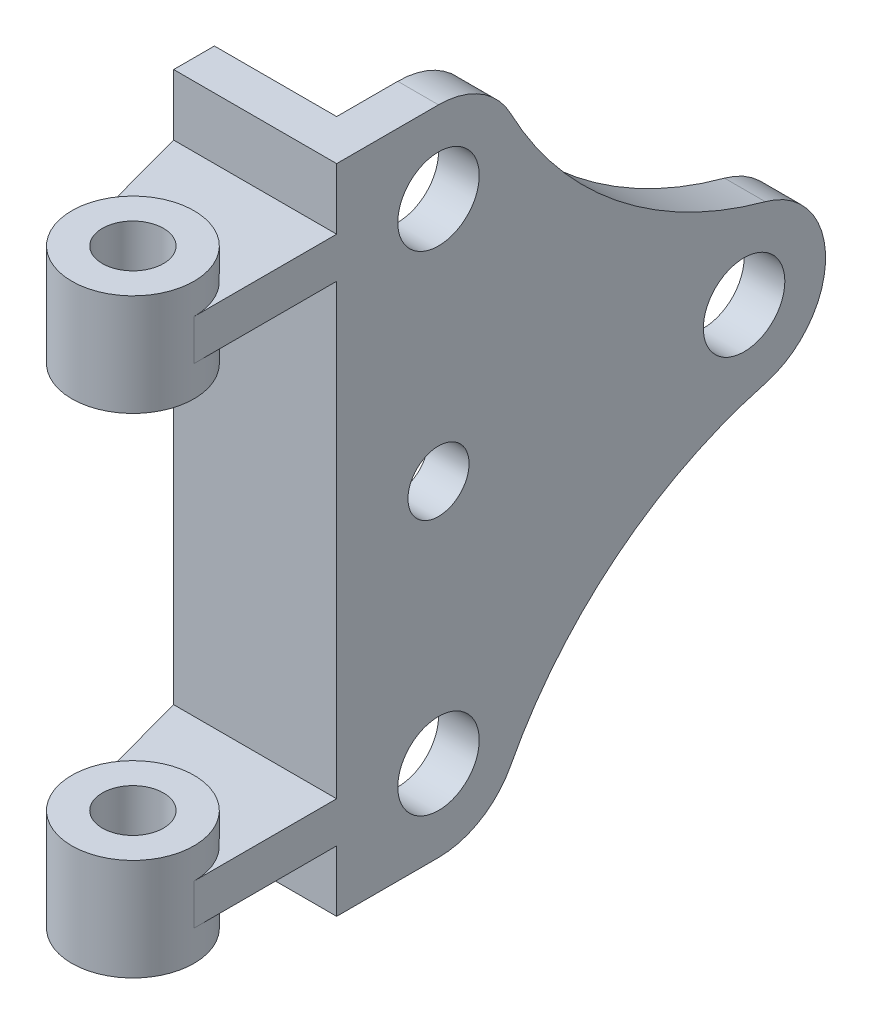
ISO-10303-21;
HEADER;
FILE_DESCRIPTION(('STEP AP214'),'2;1');
FILE_NAME('part.step','',(''),(''),'','','');
FILE_SCHEMA(('AUTOMOTIVE_DESIGN { 1 0 10303 214 1 1 1 1 }'));
ENDSEC;
DATA;
#1=APPLICATION_CONTEXT('core data for automotive mechanical design processes');
#2=APPLICATION_PROTOCOL_DEFINITION('international standard','automotive_design',2000,#1);
#3=PRODUCT_CONTEXT('',#1,'mechanical');
#4=PRODUCT('Part','Part','',(#3));
#5=PRODUCT_RELATED_PRODUCT_CATEGORY('part','',(#4));
#6=PRODUCT_DEFINITION_FORMATION('','',#4);
#7=PRODUCT_DEFINITION_CONTEXT('part definition',#1,'design');
#8=PRODUCT_DEFINITION('design','',#6,#7);
#9=PRODUCT_DEFINITION_SHAPE('','',#8);
#10=(LENGTH_UNIT() NAMED_UNIT(*) SI_UNIT(.MILLI.,.METRE.));
#11=(NAMED_UNIT(*) PLANE_ANGLE_UNIT() SI_UNIT($,.RADIAN.));
#12=(NAMED_UNIT(*) SI_UNIT($,.STERADIAN.) SOLID_ANGLE_UNIT());
#13=UNCERTAINTY_MEASURE_WITH_UNIT(LENGTH_MEASURE(1.E-05),#10,'distance_accuracy_value','');
#14=(GEOMETRIC_REPRESENTATION_CONTEXT(3) GLOBAL_UNCERTAINTY_ASSIGNED_CONTEXT((#13)) GLOBAL_UNIT_ASSIGNED_CONTEXT((#10,
#11,#12)) REPRESENTATION_CONTEXT('',''));
#15=CARTESIAN_POINT('',(0.,0.,0.));
#16=DIRECTION('',(0.,0.,1.));
#17=DIRECTION('',(1.,0.,0.));
#18=AXIS2_PLACEMENT_3D('',#15,#16,#17);
#19=CARTESIAN_POINT('',(-3.175,20.6375,22.225));
#20=DIRECTION('',(0.,-1.,0.));
#21=DIRECTION('',(0.,0.,1.));
#22=AXIS2_PLACEMENT_3D('',#19,#20,#21);
#23=PLANE('',#22);
#24=CARTESIAN_POINT('',(-3.175,20.6375,22.225));
#25=DIRECTION('',(0.,1.,0.));
#26=DIRECTION('',(0.,0.,1.));
#27=AXIS2_PLACEMENT_3D('',#24,#25,#26);
#28=CIRCLE('',#27,9.525);
#29=CARTESIAN_POINT('',(-3.175,20.6375,31.75));
#30=VERTEX_POINT('',#29);
#31=EDGE_CURVE('E696',#30,#30,#28,.T.);
#32=ORIENTED_EDGE('',*,*,#31,.T.);
#33=EDGE_LOOP('',(#32));
#34=FACE_BOUND('',#33,.T.);
#35=CARTESIAN_POINT('',(-3.175,20.6375,22.225));
#36=DIRECTION('',(0.,-1.,0.));
#37=DIRECTION('',(0.,0.,-1.));
#38=AXIS2_PLACEMENT_3D('',#35,#36,#37);
#39=CIRCLE('',#38,4.7625);
#40=CARTESIAN_POINT('',(-3.175,20.6375,17.4625));
#41=VERTEX_POINT('',#40);
#42=EDGE_CURVE('E695',#41,#41,#39,.F.);
#43=ORIENTED_EDGE('',*,*,#42,.F.);
#44=EDGE_LOOP('',(#43));
#45=FACE_BOUND('',#44,.T.);
#46=ADVANCED_FACE('F28',(#34,#45),#23,.F.);
#47=CARTESIAN_POINT('',(-3.175,4.7625,22.225));
#48=DIRECTION('',(0.,-1.,0.));
#49=DIRECTION('',(0.,0.,1.));
#50=AXIS2_PLACEMENT_3D('',#47,#48,#49);
#51=PLANE('',#50);
#52=CARTESIAN_POINT('',(-3.175,4.7625,22.225));
#53=DIRECTION('',(0.,1.,0.));
#54=DIRECTION('',(0.,0.,1.));
#55=AXIS2_PLACEMENT_3D('',#52,#53,#54);
#56=CIRCLE('',#55,9.525);
#57=CARTESIAN_POINT('',(-3.175,4.7625,31.75));
#58=VERTEX_POINT('',#57);
#59=EDGE_CURVE('E184',#58,#58,#56,.T.);
#60=ORIENTED_EDGE('',*,*,#59,.F.);
#61=EDGE_LOOP('',(#60));
#62=FACE_BOUND('',#61,.T.);
#63=CARTESIAN_POINT('',(-3.175,4.7625,22.225));
#64=DIRECTION('',(0.,1.,0.));
#65=DIRECTION('',(0.,0.,1.));
#66=AXIS2_PLACEMENT_3D('',#63,#64,#65);
#67=CIRCLE('',#66,4.7625);
#68=CARTESIAN_POINT('',(-3.175,4.7625,26.9875));
#69=VERTEX_POINT('',#68);
#70=EDGE_CURVE('E692',#69,#69,#67,.T.);
#71=ORIENTED_EDGE('',*,*,#70,.T.);
#72=EDGE_LOOP('',(#71));
#73=FACE_BOUND('',#72,.T.);
#74=ADVANCED_FACE('F450',(#62,#73),#51,.T.);
#75=CARTESIAN_POINT('',(6.35,0.,0.));
#76=DIRECTION('',(0.,0.,-1.));
#77=DIRECTION('',(-1.,0.,0.));
#78=AXIS2_PLACEMENT_3D('',#75,#76,#77);
#79=PLANE('',#78);
#80=DIRECTION('',(-1.,0.,0.));
#81=VECTOR('',#80,1.);
#82=CARTESIAN_POINT('',(-19.05,9.525,0.));
#83=LINE('',#82,#81);
#84=CARTESIAN_POINT('',(6.35,9.525,0.));
#85=VERTEX_POINT('',#84);
#86=CARTESIAN_POINT('',(-19.05,9.525,0.));
#87=VERTEX_POINT('',#86);
#88=EDGE_CURVE('E190',#85,#87,#83,.T.);
#89=ORIENTED_EDGE('',*,*,#88,.T.);
#90=DIRECTION('',(0.,-1.,0.));
#91=VECTOR('',#90,1.);
#92=CARTESIAN_POINT('',(-19.05,0.,0.));
#93=LINE('',#92,#91);
#94=CARTESIAN_POINT('',(-19.05,0.,0.));
#95=VERTEX_POINT('',#94);
#96=EDGE_CURVE('E230',#87,#95,#93,.T.);
#97=ORIENTED_EDGE('',*,*,#96,.T.);
#98=DIRECTION('',(-1.,0.,0.));
#99=VECTOR('',#98,1.);
#100=CARTESIAN_POINT('',(6.35,0.,0.));
#101=LINE('',#100,#99);
#102=CARTESIAN_POINT('',(6.35,0.,0.));
#103=VERTEX_POINT('',#102);
#104=EDGE_CURVE('E268',#103,#95,#101,.T.);
#105=ORIENTED_EDGE('',*,*,#104,.F.);
#106=DIRECTION('',(0.,-1.,0.));
#107=VECTOR('',#106,1.);
#108=CARTESIAN_POINT('',(6.35,0.,0.));
#109=LINE('',#108,#107);
#110=EDGE_CURVE('E43',#85,#103,#109,.T.);
#111=ORIENTED_EDGE('',*,*,#110,.F.);
#112=EDGE_LOOP('',(#89,#97,#105,#111));
#113=FACE_BOUND('',#112,.T.);
#114=ADVANCED_FACE('F456',(#113),#79,.F.);
#115=CARTESIAN_POINT('',(-3.175,92.075,22.225));
#116=DIRECTION('',(0.,-1.,0.));
#117=DIRECTION('',(0.,0.,-1.));
#118=AXIS2_PLACEMENT_3D('',#115,#116,#117);
#119=PLANE('',#118);
#120=CARTESIAN_POINT('',(-3.175,92.075,22.225));
#121=DIRECTION('',(0.,-1.,0.));
#122=DIRECTION('',(0.,0.,-1.));
#123=AXIS2_PLACEMENT_3D('',#120,#121,#122);
#124=CIRCLE('',#123,9.525);
#125=CARTESIAN_POINT('',(6.35,92.075,22.225));
#126=VERTEX_POINT('',#125);
#127=CARTESIAN_POINT('',(-12.3699464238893,92.075,24.7106760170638));
#128=VERTEX_POINT('',#127);
#129=EDGE_CURVE('E208',#126,#128,#124,.F.);
#130=ORIENTED_EDGE('',*,*,#129,.F.);
#131=DIRECTION('',(0.,0.,-1.));
#132=VECTOR('',#131,1.);
#133=CARTESIAN_POINT('',(6.35,92.075,0.));
#134=LINE('',#133,#132);
#135=CARTESIAN_POINT('',(6.35,92.075,0.));
#136=VERTEX_POINT('',#135);
#137=EDGE_CURVE('E398',#126,#136,#134,.T.);
#138=ORIENTED_EDGE('',*,*,#137,.T.);
#139=DIRECTION('',(-1.,0.,0.));
#140=VECTOR('',#139,1.);
#141=CARTESIAN_POINT('',(-19.05,92.075,0.));
#142=LINE('',#141,#140);
#143=CARTESIAN_POINT('',(-19.05,92.075,0.));
#144=VERTEX_POINT('',#143);
#145=EDGE_CURVE('E393',#136,#144,#142,.T.);
#146=ORIENTED_EDGE('',*,*,#145,.T.);
#147=DIRECTION('',(0.260963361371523,0.,0.965348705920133));
#148=VECTOR('',#147,1.);
#149=CARTESIAN_POINT('',(-12.3699464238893,92.075,24.7106760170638));
#150=LINE('',#149,#148);
#151=EDGE_CURVE('E220',#144,#128,#150,.T.);
#152=ORIENTED_EDGE('',*,*,#151,.T.);
#153=EDGE_LOOP('',(#130,#138,#146,#152));
#154=FACE_BOUND('',#153,.T.);
#155=ADVANCED_FACE('F422',(#154),#119,.F.);
#156=CARTESIAN_POINT('',(-3.175,85.725,22.225));
#157=DIRECTION('',(0.,-1.,0.));
#158=DIRECTION('',(0.,0.,-1.));
#159=AXIS2_PLACEMENT_3D('',#156,#157,#158);
#160=PLANE('',#159);
#161=DIRECTION('',(0.,0.,-1.));
#162=VECTOR('',#161,1.);
#163=CARTESIAN_POINT('',(6.35,85.725,0.));
#164=LINE('',#163,#162);
#165=CARTESIAN_POINT('',(6.35,85.725,22.225));
#166=VERTEX_POINT('',#165);
#167=CARTESIAN_POINT('',(6.35,85.725,0.));
#168=VERTEX_POINT('',#167);
#169=EDGE_CURVE('E221',#166,#168,#164,.T.);
#170=ORIENTED_EDGE('',*,*,#169,.F.);
#171=CARTESIAN_POINT('',(-3.175,85.725,22.225));
#172=DIRECTION('',(0.,-1.,0.));
#173=DIRECTION('',(0.,0.,-1.));
#174=AXIS2_PLACEMENT_3D('',#171,#172,#173);
#175=CIRCLE('',#174,9.525);
#176=CARTESIAN_POINT('',(-12.3699464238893,85.725,24.7106760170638));
#177=VERTEX_POINT('',#176);
#178=EDGE_CURVE('E36',#166,#177,#175,.F.);
#179=ORIENTED_EDGE('',*,*,#178,.T.);
#180=DIRECTION('',(0.260963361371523,0.,0.965348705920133));
#181=VECTOR('',#180,1.);
#182=CARTESIAN_POINT('',(-12.3699464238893,85.725,24.7106760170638));
#183=LINE('',#182,#181);
#184=CARTESIAN_POINT('',(-19.05,85.725,0.));
#185=VERTEX_POINT('',#184);
#186=EDGE_CURVE('E211',#185,#177,#183,.T.);
#187=ORIENTED_EDGE('',*,*,#186,.F.);
#188=DIRECTION('',(-1.,0.,0.));
#189=VECTOR('',#188,1.);
#190=CARTESIAN_POINT('',(-19.05,85.725,0.));
#191=LINE('',#190,#189);
#192=EDGE_CURVE('E217',#168,#185,#191,.T.);
#193=ORIENTED_EDGE('',*,*,#192,.F.);
#194=EDGE_LOOP('',(#170,#179,#187,#193));
#195=FACE_BOUND('',#194,.T.);
#196=ADVANCED_FACE('F416',(#195),#160,.T.);
#197=ORIENTED_EDGE('',*,*,#145,.F.);
#198=CARTESIAN_POINT('',(6.35,101.6,0.));
#199=VERTEX_POINT('',#198);
#200=EDGE_CURVE('E270',#199,#136,#109,.T.);
#201=ORIENTED_EDGE('',*,*,#200,.F.);
#202=DIRECTION('',(-1.,0.,0.));
#203=VECTOR('',#202,1.);
#204=CARTESIAN_POINT('',(6.35,101.6,0.));
#205=LINE('',#204,#203);
#206=CARTESIAN_POINT('',(-19.05,101.6,0.));
#207=VERTEX_POINT('',#206);
#208=EDGE_CURVE('E266',#199,#207,#205,.T.);
#209=ORIENTED_EDGE('',*,*,#208,.T.);
#210=EDGE_CURVE('E245',#207,#144,#93,.T.);
#211=ORIENTED_EDGE('',*,*,#210,.T.);
#212=EDGE_LOOP('',(#197,#201,#209,#211));
#213=FACE_BOUND('',#212,.T.);
#214=ADVANCED_FACE('F391',(#213),#79,.F.);
#215=CARTESIAN_POINT('',(0.,12.7,-15.875));
#216=DIRECTION('',(1.,0.,0.));
#217=DIRECTION('',(0.,0.,-1.));
#218=AXIS2_PLACEMENT_3D('',#215,#216,#217);
#219=PLANE('',#218);
#220=CARTESIAN_POINT('',(0.,50.8,-63.5));
#221=DIRECTION('',(1.,0.,0.));
#222=DIRECTION('',(0.,0.,-1.));
#223=AXIS2_PLACEMENT_3D('',#220,#221,#222);
#224=CIRCLE('',#223,6.35);
#225=CARTESIAN_POINT('',(0.,50.8,-69.85));
#226=VERTEX_POINT('',#225);
#227=EDGE_CURVE('E314',#226,#226,#224,.T.);
#228=ORIENTED_EDGE('',*,*,#227,.T.);
#229=EDGE_LOOP('',(#228));
#230=FACE_BOUND('',#229,.T.);
#231=CARTESIAN_POINT('',(0.,88.9,-15.875));
#232=DIRECTION('',(1.,0.,0.));
#233=DIRECTION('',(0.,0.,-1.));
#234=AXIS2_PLACEMENT_3D('',#231,#232,#233);
#235=CIRCLE('',#234,6.35);
#236=CARTESIAN_POINT('',(0.,88.9,-22.225));
#237=VERTEX_POINT('',#236);
#238=EDGE_CURVE('E320',#237,#237,#235,.T.);
#239=ORIENTED_EDGE('',*,*,#238,.T.);
#240=EDGE_LOOP('',(#239));
#241=FACE_BOUND('',#240,.T.);
#242=CARTESIAN_POINT('',(0.,12.7,-15.875));
#243=DIRECTION('',(1.,0.,0.));
#244=DIRECTION('',(0.,0.,-1.));
#245=AXIS2_PLACEMENT_3D('',#242,#243,#244);
#246=CIRCLE('',#245,6.35);
#247=CARTESIAN_POINT('',(0.,12.7,-22.225));
#248=VERTEX_POINT('',#247);
#249=EDGE_CURVE('E326',#248,#248,#246,.T.);
#250=ORIENTED_EDGE('',*,*,#249,.T.);
#251=EDGE_LOOP('',(#250));
#252=FACE_BOUND('',#251,.T.);
#253=CARTESIAN_POINT('',(0.,50.8,-15.875));
#254=DIRECTION('',(1.,0.,0.));
#255=DIRECTION('',(0.,0.,-1.));
#256=AXIS2_PLACEMENT_3D('',#253,#254,#255);
#257=CIRCLE('',#256,4.7625);
#258=CARTESIAN_POINT('',(0.,50.8,-20.6375));
#259=VERTEX_POINT('',#258);
#260=EDGE_CURVE('E332',#259,#259,#257,.T.);
#261=ORIENTED_EDGE('',*,*,#260,.T.);
#262=EDGE_LOOP('',(#261));
#263=FACE_BOUND('',#262,.T.);
#264=DIRECTION('',(0.,-1.,0.));
#265=VECTOR('',#264,1.);
#266=CARTESIAN_POINT('',(0.,12.7,-6.35));
#267=LINE('',#266,#265);
#268=CARTESIAN_POINT('',(0.,101.6,-6.35));
#269=VERTEX_POINT('',#268);
#270=CARTESIAN_POINT('',(0.,0.,-6.35));
#271=VERTEX_POINT('',#270);
#272=EDGE_CURVE('E229',#269,#271,#267,.T.);
#273=ORIENTED_EDGE('',*,*,#272,.F.);
#274=DIRECTION('',(0.,0.,1.));
#275=VECTOR('',#274,1.);
#276=CARTESIAN_POINT('',(0.,101.6,0.));
#277=LINE('',#276,#275);
#278=CARTESIAN_POINT('',(0.,101.6,-15.875));
#279=VERTEX_POINT('',#278);
#280=EDGE_CURVE('E299',#279,#269,#277,.T.);
#281=ORIENTED_EDGE('',*,*,#280,.F.);
#282=CARTESIAN_POINT('',(0.,88.9,-15.875));
#283=DIRECTION('',(1.,0.,0.));
#284=DIRECTION('',(0.,0.,1.));
#285=AXIS2_PLACEMENT_3D('',#282,#283,#284);
#286=CIRCLE('',#285,12.7);
#287=CARTESIAN_POINT('',(0.,94.8132663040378,-27.1143630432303));
#288=VERTEX_POINT('',#287);
#289=EDGE_CURVE('E302',#288,#279,#286,.T.);
#290=ORIENTED_EDGE('',*,*,#289,.F.);
#291=CARTESIAN_POINT('',(0.,124.379597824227,-83.3111782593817));
#292=DIRECTION('',(-1.,0.,0.));
#293=DIRECTION('',(0.,0.,-1.));
#294=AXIS2_PLACEMENT_3D('',#291,#292,#293);
#295=CIRCLE('',#294,63.5);
#296=CARTESIAN_POINT('',(0.,63.0632663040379,-66.8018630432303));
#297=VERTEX_POINT('',#296);
#298=EDGE_CURVE('E304',#297,#288,#295,.T.);
#299=ORIENTED_EDGE('',*,*,#298,.F.);
#300=CARTESIAN_POINT('',(0.,50.8,-63.5));
#301=DIRECTION('',(1.,0.,0.));
#302=DIRECTION('',(0.,0.,1.));
#303=AXIS2_PLACEMENT_3D('',#300,#301,#302);
#304=CIRCLE('',#303,12.7);
#305=CARTESIAN_POINT('',(0.,38.5367336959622,-66.8018630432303));
#306=VERTEX_POINT('',#305);
#307=EDGE_CURVE('E306',#306,#297,#304,.T.);
#308=ORIENTED_EDGE('',*,*,#307,.F.);
#309=CARTESIAN_POINT('',(0.,-22.7795978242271,-83.3111782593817));
#310=DIRECTION('',(-1.,0.,0.));
#311=DIRECTION('',(0.,0.,1.));
#312=AXIS2_PLACEMENT_3D('',#309,#310,#311);
#313=CIRCLE('',#312,63.5);
#314=CARTESIAN_POINT('',(0.,6.78673369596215,-27.1143630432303));
#315=VERTEX_POINT('',#314);
#316=EDGE_CURVE('E308',#315,#306,#313,.T.);
#317=ORIENTED_EDGE('',*,*,#316,.F.);
#318=CARTESIAN_POINT('',(0.,12.7,-15.875));
#319=DIRECTION('',(1.,0.,0.));
#320=DIRECTION('',(0.,0.,-1.));
#321=AXIS2_PLACEMENT_3D('',#318,#319,#320);
#322=CIRCLE('',#321,12.7);
#323=CARTESIAN_POINT('',(0.,0.,-15.875));
#324=VERTEX_POINT('',#323);
#325=EDGE_CURVE('E310',#324,#315,#322,.T.);
#326=ORIENTED_EDGE('',*,*,#325,.F.);
#327=DIRECTION('',(0.,0.,-1.));
#328=VECTOR('',#327,1.);
#329=CARTESIAN_POINT('',(0.,0.,0.));
#330=LINE('',#329,#328);
#331=EDGE_CURVE('E312',#271,#324,#330,.T.);
#332=ORIENTED_EDGE('',*,*,#331,.F.);
#333=EDGE_LOOP('',(#273,#281,#290,#299,#308,#317,#326,#332));
#334=FACE_BOUND('',#333,.T.);
#335=ADVANCED_FACE('F366',(#230,#241,#252,#263,#334),#219,.F.);
#336=CARTESIAN_POINT('',(6.35,0.,0.));
#337=DIRECTION('',(0.,1.,0.));
#338=DIRECTION('',(0.,0.,1.));
#339=AXIS2_PLACEMENT_3D('',#336,#337,#338);
#340=PLANE('',#339);
#341=ORIENTED_EDGE('',*,*,#104,.T.);
#342=DIRECTION('',(0.,0.,1.));
#343=VECTOR('',#342,1.);
#344=CARTESIAN_POINT('',(-19.05,0.,-6.35));
#345=LINE('',#344,#343);
#346=CARTESIAN_POINT('',(-19.05,0.,-6.35));
#347=VERTEX_POINT('',#346);
#348=EDGE_CURVE('E338',#347,#95,#345,.T.);
#349=ORIENTED_EDGE('',*,*,#348,.F.);
#350=DIRECTION('',(1.,0.,0.));
#351=VECTOR('',#350,1.);
#352=CARTESIAN_POINT('',(6.35,0.,-6.35));
#353=LINE('',#352,#351);
#354=EDGE_CURVE('E342',#347,#271,#353,.T.);
#355=ORIENTED_EDGE('',*,*,#354,.T.);
#356=ORIENTED_EDGE('',*,*,#331,.T.);
#357=DIRECTION('',(-1.,0.,0.));
#358=VECTOR('',#357,1.);
#359=CARTESIAN_POINT('',(6.35,0.,-15.875));
#360=LINE('',#359,#358);
#361=CARTESIAN_POINT('',(6.35,0.,-15.875));
#362=VERTEX_POINT('',#361);
#363=EDGE_CURVE('E248',#362,#324,#360,.T.);
#364=ORIENTED_EDGE('',*,*,#363,.F.);
#365=DIRECTION('',(0.,0.,-1.));
#366=VECTOR('',#365,1.);
#367=CARTESIAN_POINT('',(6.35,0.,0.));
#368=LINE('',#367,#366);
#369=EDGE_CURVE('E297',#103,#362,#368,.T.);
#370=ORIENTED_EDGE('',*,*,#369,.F.);
#371=EDGE_LOOP('',(#341,#349,#355,#356,#364,#370));
#372=FACE_BOUND('',#371,.T.);
#373=ADVANCED_FACE('F30',(#372),#340,.F.);
#374=CARTESIAN_POINT('',(6.35,12.7,-15.875));
#375=DIRECTION('',(-1.,0.,0.));
#376=DIRECTION('',(0.,0.,1.));
#377=AXIS2_PLACEMENT_3D('',#374,#375,#376);
#378=CYLINDRICAL_SURFACE('',#377,12.7);
#379=ORIENTED_EDGE('',*,*,#325,.T.);
#380=DIRECTION('',(-1.,0.,0.));
#381=VECTOR('',#380,1.);
#382=CARTESIAN_POINT('',(6.35,6.78673369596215,-27.1143630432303));
#383=LINE('',#382,#381);
#384=CARTESIAN_POINT('',(6.35,6.78673369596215,-27.1143630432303));
#385=VERTEX_POINT('',#384);
#386=EDGE_CURVE('E251',#385,#315,#383,.T.);
#387=ORIENTED_EDGE('',*,*,#386,.F.);
#388=CARTESIAN_POINT('',(6.35,12.7,-15.875));
#389=DIRECTION('',(1.,0.,0.));
#390=DIRECTION('',(0.,0.,-1.));
#391=AXIS2_PLACEMENT_3D('',#388,#389,#390);
#392=CIRCLE('',#391,12.7);
#393=EDGE_CURVE('E295',#362,#385,#392,.T.);
#394=ORIENTED_EDGE('',*,*,#393,.F.);
#395=ORIENTED_EDGE('',*,*,#363,.T.);
#396=EDGE_LOOP('',(#379,#387,#394,#395));
#397=FACE_BOUND('',#396,.T.);
#398=ADVANCED_FACE('F372',(#397),#378,.T.);
#399=CARTESIAN_POINT('',(6.35,-22.7795978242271,-83.3111782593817));
#400=DIRECTION('',(-1.,0.,0.));
#401=DIRECTION('',(0.,0.,1.));
#402=AXIS2_PLACEMENT_3D('',#399,#400,#401);
#403=CYLINDRICAL_SURFACE('',#402,63.5);
#404=ORIENTED_EDGE('',*,*,#316,.T.);
#405=DIRECTION('',(-1.,0.,0.));
#406=VECTOR('',#405,1.);
#407=CARTESIAN_POINT('',(6.35,38.5367336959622,-66.8018630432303));
#408=LINE('',#407,#406);
#409=CARTESIAN_POINT('',(6.35,38.5367336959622,-66.8018630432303));
#410=VERTEX_POINT('',#409);
#411=EDGE_CURVE('E254',#410,#306,#408,.T.);
#412=ORIENTED_EDGE('',*,*,#411,.F.);
#413=CARTESIAN_POINT('',(6.35,-22.7795978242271,-83.3111782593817));
#414=DIRECTION('',(-1.,0.,0.));
#415=DIRECTION('',(0.,0.,1.));
#416=AXIS2_PLACEMENT_3D('',#413,#414,#415);
#417=CIRCLE('',#416,63.5);
#418=EDGE_CURVE('E293',#385,#410,#417,.T.);
#419=ORIENTED_EDGE('',*,*,#418,.F.);
#420=ORIENTED_EDGE('',*,*,#386,.T.);
#421=EDGE_LOOP('',(#404,#412,#419,#420));
#422=FACE_BOUND('',#421,.T.);
#423=ADVANCED_FACE('F377',(#422),#403,.F.);
#424=CARTESIAN_POINT('',(6.35,50.8,-63.5));
#425=DIRECTION('',(-1.,0.,0.));
#426=DIRECTION('',(0.,0.,1.));
#427=AXIS2_PLACEMENT_3D('',#424,#425,#426);
#428=CYLINDRICAL_SURFACE('',#427,12.7);
#429=ORIENTED_EDGE('',*,*,#307,.T.);
#430=DIRECTION('',(-1.,0.,0.));
#431=VECTOR('',#430,1.);
#432=CARTESIAN_POINT('',(6.35,63.0632663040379,-66.8018630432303));
#433=LINE('',#432,#431);
#434=CARTESIAN_POINT('',(6.35,63.0632663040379,-66.8018630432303));
#435=VERTEX_POINT('',#434);
#436=EDGE_CURVE('E257',#435,#297,#433,.T.);
#437=ORIENTED_EDGE('',*,*,#436,.F.);
#438=CARTESIAN_POINT('',(6.35,50.8,-63.5));
#439=DIRECTION('',(1.,0.,0.));
#440=DIRECTION('',(0.,0.,1.));
#441=AXIS2_PLACEMENT_3D('',#438,#439,#440);
#442=CIRCLE('',#441,12.7);
#443=EDGE_CURVE('E289',#410,#435,#442,.T.);
#444=ORIENTED_EDGE('',*,*,#443,.F.);
#445=ORIENTED_EDGE('',*,*,#411,.T.);
#446=EDGE_LOOP('',(#429,#437,#444,#445));
#447=FACE_BOUND('',#446,.T.);
#448=ADVANCED_FACE('F381',(#447),#428,.T.);
#449=CARTESIAN_POINT('',(6.35,124.379597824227,-83.3111782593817));
#450=DIRECTION('',(-1.,0.,0.));
#451=DIRECTION('',(0.,0.,1.));
#452=AXIS2_PLACEMENT_3D('',#449,#450,#451);
#453=CYLINDRICAL_SURFACE('',#452,63.5);
#454=ORIENTED_EDGE('',*,*,#298,.T.);
#455=DIRECTION('',(-1.,0.,0.));
#456=VECTOR('',#455,1.);
#457=CARTESIAN_POINT('',(6.35,94.8132663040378,-27.1143630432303));
#458=LINE('',#457,#456);
#459=CARTESIAN_POINT('',(6.35,94.8132663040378,-27.1143630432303));
#460=VERTEX_POINT('',#459);
#461=EDGE_CURVE('E260',#460,#288,#458,.T.);
#462=ORIENTED_EDGE('',*,*,#461,.F.);
#463=CARTESIAN_POINT('',(6.35,124.379597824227,-83.3111782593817));
#464=DIRECTION('',(-1.,0.,0.));
#465=DIRECTION('',(0.,0.,-1.));
#466=AXIS2_PLACEMENT_3D('',#463,#464,#465);
#467=CIRCLE('',#466,63.5);
#468=EDGE_CURVE('E286',#435,#460,#467,.T.);
#469=ORIENTED_EDGE('',*,*,#468,.F.);
#470=ORIENTED_EDGE('',*,*,#436,.T.);
#471=EDGE_LOOP('',(#454,#462,#469,#470));
#472=FACE_BOUND('',#471,.T.);
#473=ADVANCED_FACE('F385',(#472),#453,.F.);
#474=CARTESIAN_POINT('',(6.35,88.9,-15.875));
#475=DIRECTION('',(-1.,0.,0.));
#476=DIRECTION('',(0.,0.,1.));
#477=AXIS2_PLACEMENT_3D('',#474,#475,#476);
#478=CYLINDRICAL_SURFACE('',#477,12.7);
#479=ORIENTED_EDGE('',*,*,#289,.T.);
#480=DIRECTION('',(-1.,0.,0.));
#481=VECTOR('',#480,1.);
#482=CARTESIAN_POINT('',(6.35,101.6,-15.875));
#483=LINE('',#482,#481);
#484=CARTESIAN_POINT('',(6.35,101.6,-15.875));
#485=VERTEX_POINT('',#484);
#486=EDGE_CURVE('E263',#485,#279,#483,.T.);
#487=ORIENTED_EDGE('',*,*,#486,.F.);
#488=CARTESIAN_POINT('',(6.35,88.9,-15.875));
#489=DIRECTION('',(1.,0.,0.));
#490=DIRECTION('',(0.,0.,1.));
#491=AXIS2_PLACEMENT_3D('',#488,#489,#490);
#492=CIRCLE('',#491,12.7);
#493=EDGE_CURVE('E283',#460,#485,#492,.T.);
#494=ORIENTED_EDGE('',*,*,#493,.F.);
#495=ORIENTED_EDGE('',*,*,#461,.T.);
#496=EDGE_LOOP('',(#479,#487,#494,#495));
#497=FACE_BOUND('',#496,.T.);
#498=ADVANCED_FACE('F389',(#497),#478,.T.);
#499=CARTESIAN_POINT('',(6.35,101.6,0.));
#500=DIRECTION('',(0.,-1.,0.));
#501=DIRECTION('',(0.,0.,-1.));
#502=AXIS2_PLACEMENT_3D('',#499,#500,#501);
#503=PLANE('',#502);
#504=ORIENTED_EDGE('',*,*,#208,.F.);
#505=DIRECTION('',(0.,0.,1.));
#506=VECTOR('',#505,1.);
#507=CARTESIAN_POINT('',(6.35,101.6,0.));
#508=LINE('',#507,#506);
#509=EDGE_CURVE('E273',#485,#199,#508,.T.);
#510=ORIENTED_EDGE('',*,*,#509,.F.);
#511=ORIENTED_EDGE('',*,*,#486,.T.);
#512=ORIENTED_EDGE('',*,*,#280,.T.);
#513=DIRECTION('',(-1.,0.,0.));
#514=VECTOR('',#513,1.);
#515=CARTESIAN_POINT('',(6.35,101.6,-6.35));
#516=LINE('',#515,#514);
#517=CARTESIAN_POINT('',(-19.05,101.6,-6.35));
#518=VERTEX_POINT('',#517);
#519=EDGE_CURVE('E238',#269,#518,#516,.T.);
#520=ORIENTED_EDGE('',*,*,#519,.T.);
#521=DIRECTION('',(0.,0.,1.));
#522=VECTOR('',#521,1.);
#523=CARTESIAN_POINT('',(-19.05,101.6,-6.35));
#524=LINE('',#523,#522);
#525=EDGE_CURVE('E339',#518,#207,#524,.T.);
#526=ORIENTED_EDGE('',*,*,#525,.T.);
#527=EDGE_LOOP('',(#504,#510,#511,#512,#520,#526));
#528=FACE_BOUND('',#527,.T.);
#529=ADVANCED_FACE('F353',(#528),#503,.F.);
#530=CARTESIAN_POINT('',(-19.05,15.875,0.));
#531=VERTEX_POINT('',#530);
#532=EDGE_CURVE('E232',#185,#531,#93,.T.);
#533=ORIENTED_EDGE('',*,*,#532,.T.);
#534=DIRECTION('',(-1.,0.,0.));
#535=VECTOR('',#534,1.);
#536=CARTESIAN_POINT('',(-19.05,15.875,0.));
#537=LINE('',#536,#535);
#538=CARTESIAN_POINT('',(6.35,15.875,0.));
#539=VERTEX_POINT('',#538);
#540=EDGE_CURVE('E51',#539,#531,#537,.T.);
#541=ORIENTED_EDGE('',*,*,#540,.F.);
#542=EDGE_CURVE('E163',#168,#539,#109,.T.);
#543=ORIENTED_EDGE('',*,*,#542,.F.);
#544=ORIENTED_EDGE('',*,*,#192,.T.);
#545=EDGE_LOOP('',(#533,#541,#543,#544));
#546=FACE_BOUND('',#545,.T.);
#547=ADVANCED_FACE('F418',(#546),#79,.F.);
#548=CARTESIAN_POINT('',(6.35,12.7,-15.875));
#549=DIRECTION('',(1.,0.,0.));
#550=DIRECTION('',(0.,0.,-1.));
#551=AXIS2_PLACEMENT_3D('',#548,#549,#550);
#552=PLANE('',#551);
#553=ORIENTED_EDGE('',*,*,#369,.T.);
#554=ORIENTED_EDGE('',*,*,#393,.T.);
#555=ORIENTED_EDGE('',*,*,#418,.T.);
#556=ORIENTED_EDGE('',*,*,#443,.T.);
#557=ORIENTED_EDGE('',*,*,#468,.T.);
#558=ORIENTED_EDGE('',*,*,#493,.T.);
#559=ORIENTED_EDGE('',*,*,#509,.T.);
#560=ORIENTED_EDGE('',*,*,#200,.T.);
#561=ORIENTED_EDGE('',*,*,#137,.F.);
#562=DIRECTION('',(0.,-1.,0.));
#563=VECTOR('',#562,1.);
#564=CARTESIAN_POINT('',(6.35,92.075,22.225));
#565=LINE('',#564,#563);
#566=EDGE_CURVE('E400',#126,#166,#565,.T.);
#567=ORIENTED_EDGE('',*,*,#566,.T.);
#568=ORIENTED_EDGE('',*,*,#169,.T.);
#569=ORIENTED_EDGE('',*,*,#542,.T.);
#570=DIRECTION('',(0.,0.,-1.));
#571=VECTOR('',#570,1.);
#572=CARTESIAN_POINT('',(6.35,15.875,0.));
#573=LINE('',#572,#571);
#574=CARTESIAN_POINT('',(6.35,15.875,22.225));
#575=VERTEX_POINT('',#574);
#576=EDGE_CURVE('E155',#575,#539,#573,.T.);
#577=ORIENTED_EDGE('',*,*,#576,.F.);
#578=DIRECTION('',(0.,1.,0.));
#579=VECTOR('',#578,1.);
#580=CARTESIAN_POINT('',(6.35,9.525,22.225));
#581=LINE('',#580,#579);
#582=CARTESIAN_POINT('',(6.35,9.525,22.225));
#583=VERTEX_POINT('',#582);
#584=EDGE_CURVE('E160',#583,#575,#581,.T.);
#585=ORIENTED_EDGE('',*,*,#584,.F.);
#586=DIRECTION('',(0.,0.,-1.));
#587=VECTOR('',#586,1.);
#588=CARTESIAN_POINT('',(6.35,9.525,0.));
#589=LINE('',#588,#587);
#590=EDGE_CURVE('E192',#583,#85,#589,.T.);
#591=ORIENTED_EDGE('',*,*,#590,.T.);
#592=ORIENTED_EDGE('',*,*,#110,.T.);
#593=EDGE_LOOP('',(#553,#554,#555,#556,#557,#558,#559,#560,#561,#567,#568,#569,#577,#585,#591,#592));
#594=FACE_BOUND('',#593,.T.);
#595=CARTESIAN_POINT('',(6.35,50.8,-63.5));
#596=DIRECTION('',(1.,0.,0.));
#597=DIRECTION('',(0.,0.,-1.));
#598=AXIS2_PLACEMENT_3D('',#595,#596,#597);
#599=CIRCLE('',#598,6.35);
#600=CARTESIAN_POINT('',(6.35,50.8,-69.85));
#601=VERTEX_POINT('',#600);
#602=EDGE_CURVE('E317',#601,#601,#599,.T.);
#603=ORIENTED_EDGE('',*,*,#602,.F.);
#604=EDGE_LOOP('',(#603));
#605=FACE_BOUND('',#604,.T.);
#606=CARTESIAN_POINT('',(6.35,88.9,-15.875));
#607=DIRECTION('',(1.,0.,0.));
#608=DIRECTION('',(0.,0.,-1.));
#609=AXIS2_PLACEMENT_3D('',#606,#607,#608);
#610=CIRCLE('',#609,6.35);
#611=CARTESIAN_POINT('',(6.35,88.9,-22.225));
#612=VERTEX_POINT('',#611);
#613=EDGE_CURVE('E323',#612,#612,#610,.T.);
#614=ORIENTED_EDGE('',*,*,#613,.F.);
#615=EDGE_LOOP('',(#614));
#616=FACE_BOUND('',#615,.T.);
#617=CARTESIAN_POINT('',(6.35,12.7,-15.875));
#618=DIRECTION('',(1.,0.,0.));
#619=DIRECTION('',(0.,0.,-1.));
#620=AXIS2_PLACEMENT_3D('',#617,#618,#619);
#621=CIRCLE('',#620,6.35);
#622=CARTESIAN_POINT('',(6.35,12.7,-22.225));
#623=VERTEX_POINT('',#622);
#624=EDGE_CURVE('E329',#623,#623,#621,.T.);
#625=ORIENTED_EDGE('',*,*,#624,.F.);
#626=EDGE_LOOP('',(#625));
#627=FACE_BOUND('',#626,.T.);
#628=CARTESIAN_POINT('',(6.35,50.8,-15.875));
#629=DIRECTION('',(1.,0.,0.));
#630=DIRECTION('',(0.,0.,-1.));
#631=AXIS2_PLACEMENT_3D('',#628,#629,#630);
#632=CIRCLE('',#631,4.7625);
#633=CARTESIAN_POINT('',(6.35,50.8,-20.6375));
#634=VERTEX_POINT('',#633);
#635=EDGE_CURVE('E335',#634,#634,#632,.T.);
#636=ORIENTED_EDGE('',*,*,#635,.F.);
#637=EDGE_LOOP('',(#636));
#638=FACE_BOUND('',#637,.T.);
#639=ADVANCED_FACE('F157',(#594,#605,#616,#627,#638),#552,.T.);
#640=CARTESIAN_POINT('',(0.,50.8,-63.5));
#641=DIRECTION('',(1.,0.,0.));
#642=DIRECTION('',(0.,0.,-1.));
#643=AXIS2_PLACEMENT_3D('',#640,#641,#642);
#644=CYLINDRICAL_SURFACE('',#643,6.35);
#645=ORIENTED_EDGE('',*,*,#227,.F.);
#646=EDGE_LOOP('',(#645));
#647=FACE_BOUND('',#646,.T.);
#648=ORIENTED_EDGE('',*,*,#602,.T.);
#649=EDGE_LOOP('',(#648));
#650=FACE_BOUND('',#649,.T.);
#651=ADVANCED_FACE('F523',(#647,#650),#644,.F.);
#652=CARTESIAN_POINT('',(0.,88.9,-15.875));
#653=DIRECTION('',(1.,0.,0.));
#654=DIRECTION('',(0.,0.,-1.));
#655=AXIS2_PLACEMENT_3D('',#652,#653,#654);
#656=CYLINDRICAL_SURFACE('',#655,6.35);
#657=ORIENTED_EDGE('',*,*,#238,.F.);
#658=EDGE_LOOP('',(#657));
#659=FACE_BOUND('',#658,.T.);
#660=ORIENTED_EDGE('',*,*,#613,.T.);
#661=EDGE_LOOP('',(#660));
#662=FACE_BOUND('',#661,.T.);
#663=ADVANCED_FACE('F601',(#659,#662),#656,.F.);
#664=CARTESIAN_POINT('',(0.,12.7,-15.875));
#665=DIRECTION('',(1.,0.,0.));
#666=DIRECTION('',(0.,0.,-1.));
#667=AXIS2_PLACEMENT_3D('',#664,#665,#666);
#668=CYLINDRICAL_SURFACE('',#667,6.35);
#669=ORIENTED_EDGE('',*,*,#249,.F.);
#670=EDGE_LOOP('',(#669));
#671=FACE_BOUND('',#670,.T.);
#672=ORIENTED_EDGE('',*,*,#624,.T.);
#673=EDGE_LOOP('',(#672));
#674=FACE_BOUND('',#673,.T.);
#675=ADVANCED_FACE('F593',(#671,#674),#668,.F.);
#676=CARTESIAN_POINT('',(0.,50.8,-15.875));
#677=DIRECTION('',(1.,0.,0.));
#678=DIRECTION('',(0.,0.,-1.));
#679=AXIS2_PLACEMENT_3D('',#676,#677,#678);
#680=CYLINDRICAL_SURFACE('',#679,4.7625);
#681=ORIENTED_EDGE('',*,*,#260,.F.);
#682=EDGE_LOOP('',(#681));
#683=FACE_BOUND('',#682,.T.);
#684=ORIENTED_EDGE('',*,*,#635,.T.);
#685=EDGE_LOOP('',(#684));
#686=FACE_BOUND('',#685,.T.);
#687=ADVANCED_FACE('F567',(#683,#686),#680,.F.);
#688=CARTESIAN_POINT('',(6.35,0.,-6.35));
#689=DIRECTION('',(0.,0.,1.));
#690=DIRECTION('',(1.,0.,0.));
#691=AXIS2_PLACEMENT_3D('',#688,#689,#690);
#692=PLANE('',#691);
#693=ORIENTED_EDGE('',*,*,#519,.F.);
#694=ORIENTED_EDGE('',*,*,#272,.T.);
#695=ORIENTED_EDGE('',*,*,#354,.F.);
#696=DIRECTION('',(0.,-1.,0.));
#697=VECTOR('',#696,1.);
#698=CARTESIAN_POINT('',(-19.05,0.,-6.35));
#699=LINE('',#698,#697);
#700=EDGE_CURVE('E346',#518,#347,#699,.T.);
#701=ORIENTED_EDGE('',*,*,#700,.F.);
#702=EDGE_LOOP('',(#693,#694,#695,#701));
#703=FACE_BOUND('',#702,.T.);
#704=ADVANCED_FACE('F360',(#703),#692,.F.);
#705=CARTESIAN_POINT('',(-19.05,0.,-6.35));
#706=DIRECTION('',(-1.,0.,0.));
#707=DIRECTION('',(0.,0.,1.));
#708=AXIS2_PLACEMENT_3D('',#705,#706,#707);
#709=PLANE('',#708);
#710=ORIENTED_EDGE('',*,*,#210,.F.);
#711=ORIENTED_EDGE('',*,*,#525,.F.);
#712=ORIENTED_EDGE('',*,*,#700,.T.);
#713=ORIENTED_EDGE('',*,*,#348,.T.);
#714=ORIENTED_EDGE('',*,*,#96,.F.);
#715=DIRECTION('',(0.,1.,0.));
#716=VECTOR('',#715,1.);
#717=CARTESIAN_POINT('',(-19.05,9.525,0.));
#718=LINE('',#717,#716);
#719=EDGE_CURVE('E173',#87,#531,#718,.T.);
#720=ORIENTED_EDGE('',*,*,#719,.T.);
#721=ORIENTED_EDGE('',*,*,#532,.F.);
#722=DIRECTION('',(0.,-1.,0.));
#723=VECTOR('',#722,1.);
#724=CARTESIAN_POINT('',(-19.05,92.075,0.));
#725=LINE('',#724,#723);
#726=EDGE_CURVE('E397',#144,#185,#725,.T.);
#727=ORIENTED_EDGE('',*,*,#726,.F.);
#728=EDGE_LOOP('',(#710,#711,#712,#713,#714,#720,#721,#727));
#729=FACE_BOUND('',#728,.T.);
#730=ADVANCED_FACE('F358',(#729),#709,.T.);
#731=CARTESIAN_POINT('',(-12.3699464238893,92.075,24.7106760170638));
#732=DIRECTION('',(0.965348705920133,0.,-0.260963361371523));
#733=DIRECTION('',(-0.260963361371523,0.,-0.965348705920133));
#734=AXIS2_PLACEMENT_3D('',#731,#732,#733);
#735=PLANE('',#734);
#736=ORIENTED_EDGE('',*,*,#186,.T.);
#737=DIRECTION('',(0.,-1.,0.));
#738=VECTOR('',#737,1.);
#739=CARTESIAN_POINT('',(-12.3699464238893,92.075,24.7106760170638));
#740=LINE('',#739,#738);
#741=EDGE_CURVE('E233',#128,#177,#740,.T.);
#742=ORIENTED_EDGE('',*,*,#741,.F.);
#743=ORIENTED_EDGE('',*,*,#151,.F.);
#744=ORIENTED_EDGE('',*,*,#726,.T.);
#745=EDGE_LOOP('',(#736,#742,#743,#744));
#746=FACE_BOUND('',#745,.T.);
#747=ADVANCED_FACE('F420',(#746),#735,.F.);
#748=CARTESIAN_POINT('',(-3.175,92.075,22.225));
#749=DIRECTION('',(0.,-1.,0.));
#750=DIRECTION('',(0.,0.,-1.));
#751=AXIS2_PLACEMENT_3D('',#748,#749,#750);
#752=CYLINDRICAL_SURFACE('',#751,9.525);
#753=ORIENTED_EDGE('',*,*,#741,.T.);
#754=ORIENTED_EDGE('',*,*,#178,.F.);
#755=ORIENTED_EDGE('',*,*,#566,.F.);
#756=ORIENTED_EDGE('',*,*,#129,.T.);
#757=EDGE_LOOP('',(#753,#754,#755,#756));
#758=FACE_BOUND('',#757,.T.);
#759=CARTESIAN_POINT('',(-3.175,80.9625,22.225));
#760=DIRECTION('',(0.,1.,0.));
#761=DIRECTION('',(0.,0.,1.));
#762=AXIS2_PLACEMENT_3D('',#759,#760,#761);
#763=CIRCLE('',#762,9.525);
#764=CARTESIAN_POINT('',(-3.175,80.9625,31.75));
#765=VERTEX_POINT('',#764);
#766=EDGE_CURVE('E202',#765,#765,#763,.T.);
#767=ORIENTED_EDGE('',*,*,#766,.T.);
#768=EDGE_LOOP('',(#767));
#769=FACE_BOUND('',#768,.T.);
#770=CARTESIAN_POINT('',(-3.175,96.8375,22.225));
#771=DIRECTION('',(0.,1.,0.));
#772=DIRECTION('',(0.,0.,1.));
#773=AXIS2_PLACEMENT_3D('',#770,#771,#772);
#774=CIRCLE('',#773,9.525);
#775=CARTESIAN_POINT('',(-3.175,96.8375,31.75));
#776=VERTEX_POINT('',#775);
#777=EDGE_CURVE('E205',#776,#776,#774,.T.);
#778=ORIENTED_EDGE('',*,*,#777,.F.);
#779=EDGE_LOOP('',(#778));
#780=FACE_BOUND('',#779,.T.);
#781=ADVANCED_FACE('F424',(#758,#769,#780),#752,.T.);
#782=CARTESIAN_POINT('',(-3.175,80.9625,22.225));
#783=DIRECTION('',(0.,1.,0.));
#784=DIRECTION('',(0.,0.,1.));
#785=AXIS2_PLACEMENT_3D('',#782,#783,#784);
#786=PLANE('',#785);
#787=CARTESIAN_POINT('',(-3.175,80.9625,22.225));
#788=DIRECTION('',(0.,1.,0.));
#789=DIRECTION('',(0.,0.,1.));
#790=AXIS2_PLACEMENT_3D('',#787,#788,#789);
#791=CIRCLE('',#790,4.7625);
#792=CARTESIAN_POINT('',(-3.175,80.9625,26.9875));
#793=VERTEX_POINT('',#792);
#794=EDGE_CURVE('E199',#793,#793,#791,.T.);
#795=ORIENTED_EDGE('',*,*,#794,.T.);
#796=EDGE_LOOP('',(#795));
#797=FACE_BOUND('',#796,.T.);
#798=ORIENTED_EDGE('',*,*,#766,.F.);
#799=EDGE_LOOP('',(#798));
#800=FACE_BOUND('',#799,.T.);
#801=ADVANCED_FACE('F427',(#797,#800),#786,.F.);
#802=CARTESIAN_POINT('',(-3.175,96.8375,22.225));
#803=DIRECTION('',(0.,1.,0.));
#804=DIRECTION('',(0.,0.,1.));
#805=AXIS2_PLACEMENT_3D('',#802,#803,#804);
#806=PLANE('',#805);
#807=CARTESIAN_POINT('',(-3.175,96.8375,22.225));
#808=DIRECTION('',(0.,1.,0.));
#809=DIRECTION('',(0.,0.,1.));
#810=AXIS2_PLACEMENT_3D('',#807,#808,#809);
#811=CIRCLE('',#810,4.7625);
#812=CARTESIAN_POINT('',(-3.175,96.8375,26.9875));
#813=VERTEX_POINT('',#812);
#814=EDGE_CURVE('E196',#813,#813,#811,.T.);
#815=ORIENTED_EDGE('',*,*,#814,.F.);
#816=EDGE_LOOP('',(#815));
#817=FACE_BOUND('',#816,.T.);
#818=ORIENTED_EDGE('',*,*,#777,.T.);
#819=EDGE_LOOP('',(#818));
#820=FACE_BOUND('',#819,.T.);
#821=ADVANCED_FACE('F433',(#817,#820),#806,.T.);
#822=CARTESIAN_POINT('',(-3.175,-2.50000000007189E-05,22.225));
#823=DIRECTION('',(0.,1.,0.));
#824=DIRECTION('',(0.,0.,1.));
#825=AXIS2_PLACEMENT_3D('',#822,#823,#824);
#826=CYLINDRICAL_SURFACE('',#825,4.7625);
#827=CARTESIAN_POINT('',(-3.175,96.8375,26.9875));
#828=CARTESIAN_POINT('',(-3.175,96.6721354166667,26.9875));
#829=CARTESIAN_POINT('',(-3.175,96.5067708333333,26.9875));
#830=CARTESIAN_POINT('',(-3.175,96.1760416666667,26.9875));
#831=CARTESIAN_POINT('',(-3.175,96.0106770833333,26.9875));
#832=CARTESIAN_POINT('',(-3.175,95.6799479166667,26.9875));
#833=CARTESIAN_POINT('',(-3.175,95.5145833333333,26.9875));
#834=CARTESIAN_POINT('',(-3.175,95.1838541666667,26.9875));
#835=CARTESIAN_POINT('',(-3.175,95.0184895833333,26.9875));
#836=CARTESIAN_POINT('',(-3.175,94.6877604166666,26.9875));
#837=CARTESIAN_POINT('',(-3.175,94.5223958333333,26.9875));
#838=CARTESIAN_POINT('',(-3.175,94.1916666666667,26.9875));
#839=CARTESIAN_POINT('',(-3.175,94.0263020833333,26.9875));
#840=CARTESIAN_POINT('',(-3.175,93.6955729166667,26.9875));
#841=CARTESIAN_POINT('',(-3.175,93.5302083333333,26.9875));
#842=CARTESIAN_POINT('',(-3.175,93.1994791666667,26.9875));
#843=CARTESIAN_POINT('',(-3.175,93.0341145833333,26.9875));
#844=CARTESIAN_POINT('',(-3.175,92.7033854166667,26.9875));
#845=CARTESIAN_POINT('',(-3.175,92.5380208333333,26.9875));
#846=CARTESIAN_POINT('',(-3.175,92.2072916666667,26.9875));
#847=CARTESIAN_POINT('',(-3.175,92.0419270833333,26.9875));
#848=CARTESIAN_POINT('',(-3.175,91.7111979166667,26.9875));
#849=CARTESIAN_POINT('',(-3.175,91.5458333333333,26.9875));
#850=CARTESIAN_POINT('',(-3.175,91.2151041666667,26.9875));
#851=CARTESIAN_POINT('',(-3.175,91.0497395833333,26.9875));
#852=CARTESIAN_POINT('',(-3.175,90.7190104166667,26.9875));
#853=CARTESIAN_POINT('',(-3.175,90.5536458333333,26.9875));
#854=CARTESIAN_POINT('',(-3.175,90.2229166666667,26.9875));
#855=CARTESIAN_POINT('',(-3.175,90.0575520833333,26.9875));
#856=CARTESIAN_POINT('',(-3.175,89.7268229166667,26.9875));
#857=CARTESIAN_POINT('',(-3.175,89.5614583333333,26.9875));
#858=CARTESIAN_POINT('',(-3.175,89.2307291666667,26.9875));
#859=CARTESIAN_POINT('',(-3.175,89.0653645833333,26.9875));
#860=CARTESIAN_POINT('',(-3.175,88.7346354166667,26.9875));
#861=CARTESIAN_POINT('',(-3.175,88.5692708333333,26.9875));
#862=CARTESIAN_POINT('',(-3.175,88.2385416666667,26.9875));
#863=CARTESIAN_POINT('',(-3.175,88.0731770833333,26.9875));
#864=CARTESIAN_POINT('',(-3.175,87.7424479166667,26.9875));
#865=CARTESIAN_POINT('',(-3.175,87.5770833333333,26.9875));
#866=CARTESIAN_POINT('',(-3.175,87.2463541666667,26.9875));
#867=CARTESIAN_POINT('',(-3.175,87.0809895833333,26.9875));
#868=CARTESIAN_POINT('',(-3.175,86.7502604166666,26.9875));
#869=CARTESIAN_POINT('',(-3.175,86.5848958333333,26.9875));
#870=CARTESIAN_POINT('',(-3.175,86.2541666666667,26.9875));
#871=CARTESIAN_POINT('',(-3.175,86.0888020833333,26.9875));
#872=CARTESIAN_POINT('',(-3.175,85.7580729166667,26.9875));
#873=CARTESIAN_POINT('',(-3.175,85.5927083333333,26.9875));
#874=CARTESIAN_POINT('',(-3.175,85.2619791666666,26.9875));
#875=CARTESIAN_POINT('',(-3.175,85.0966145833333,26.9875));
#876=CARTESIAN_POINT('',(-3.175,84.7658854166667,26.9875));
#877=CARTESIAN_POINT('',(-3.175,84.6005208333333,26.9875));
#878=CARTESIAN_POINT('',(-3.175,84.2697916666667,26.9875));
#879=CARTESIAN_POINT('',(-3.175,84.1044270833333,26.9875));
#880=CARTESIAN_POINT('',(-3.175,83.7736979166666,26.9875));
#881=CARTESIAN_POINT('',(-3.175,83.6083333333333,26.9875));
#882=CARTESIAN_POINT('',(-3.175,83.2776041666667,26.9875));
#883=CARTESIAN_POINT('',(-3.175,83.1122395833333,26.9875));
#884=CARTESIAN_POINT('',(-3.175,82.7815104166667,26.9875));
#885=CARTESIAN_POINT('',(-3.175,82.6161458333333,26.9875));
#886=CARTESIAN_POINT('',(-3.175,82.2854166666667,26.9875));
#887=CARTESIAN_POINT('',(-3.175,82.1200520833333,26.9875));
#888=CARTESIAN_POINT('',(-3.175,81.7893229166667,26.9875));
#889=CARTESIAN_POINT('',(-3.175,81.6239583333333,26.9875));
#890=CARTESIAN_POINT('',(-3.175,81.2932291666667,26.9875));
#891=CARTESIAN_POINT('',(-3.175,81.1278645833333,26.9875));
#892=CARTESIAN_POINT('',(-3.175,80.9625,26.9875));
#893=B_SPLINE_CURVE_WITH_KNOTS('',3,(#827,#828,#829,#830,#831,#832,#833,#834,#835,#836,#837,
#838,#839,#840,#841,#842,#843,#844,#845,#846,#847,#848,#849,#850,#851,#852,#853,#854,#855,#856,
#857,#858,#859,#860,#861,#862,#863,#864,#865,#866,#867,#868,#869,#870,#871,#872,#873,#874,#875,
#876,#877,#878,#879,#880,#881,#882,#883,#884,#885,#886,#887,#888,#889,#890,#891,#892),
.UNSPECIFIED.,.F.,.F.,(4,2,2,2,2,2,2,2,2,2,2,2,2,2,2,2,2,2,2,2,2,2,2,2,2,2,2,2,2,2,2,2,4),(0.,
0.496093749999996,0.992187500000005,1.48828125,1.984375,2.48046875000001,2.9765625,3.47265625,
3.96874999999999,4.46484375,4.9609375,5.45703124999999,5.953125,6.44921875,6.94531249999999,
7.44140625,7.9375,8.43359375,8.92968750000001,9.42578125,9.921875,10.41796875,10.9140625,
11.41015625,11.90625,12.40234375,12.8984375,13.39453125,13.890625,14.38671875,14.8828125,
15.37890625,15.875),.UNSPECIFIED.);
#894=EDGE_CURVE('BSEAM435',#813,#793,#893,.T.);
#895=ORIENTED_EDGE('',*,*,#814,.T.);
#896=ORIENTED_EDGE('',*,*,#794,.F.);
#897=ORIENTED_EDGE('',*,*,#894,.T.);
#898=ORIENTED_EDGE('',*,*,#894,.F.);
#899=EDGE_LOOP('',(#895,#897,#896,#898));
#900=FACE_BOUND('',#899,.T.);
#901=ADVANCED_FACE('F435',(#900),#826,.F.);
#902=CARTESIAN_POINT('',(-12.3699464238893,9.525,24.7106760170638));
#903=DIRECTION('',(-0.965348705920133,0.,0.260963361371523));
#904=DIRECTION('',(0.260963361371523,0.,0.965348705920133));
#905=AXIS2_PLACEMENT_3D('',#902,#903,#904);
#906=PLANE('',#905);
#907=DIRECTION('',(0.260963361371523,0.,0.965348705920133));
#908=VECTOR('',#907,1.);
#909=CARTESIAN_POINT('',(-12.3699464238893,15.875,24.7106760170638));
#910=LINE('',#909,#908);
#911=CARTESIAN_POINT('',(-12.3699464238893,15.875,24.7106760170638));
#912=VERTEX_POINT('',#911);
#913=EDGE_CURVE('E179',#531,#912,#910,.T.);
#914=ORIENTED_EDGE('',*,*,#913,.F.);
#915=ORIENTED_EDGE('',*,*,#719,.F.);
#916=DIRECTION('',(0.260963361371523,0.,0.965348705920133));
#917=VECTOR('',#916,1.);
#918=CARTESIAN_POINT('',(-12.3699464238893,9.525,24.7106760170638));
#919=LINE('',#918,#917);
#920=CARTESIAN_POINT('',(-12.3699464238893,9.525,24.7106760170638));
#921=VERTEX_POINT('',#920);
#922=EDGE_CURVE('E166',#87,#921,#919,.T.);
#923=ORIENTED_EDGE('',*,*,#922,.T.);
#924=DIRECTION('',(0.,1.,0.));
#925=VECTOR('',#924,1.);
#926=CARTESIAN_POINT('',(-12.3699464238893,9.525,24.7106760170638));
#927=LINE('',#926,#925);
#928=EDGE_CURVE('E174',#921,#912,#927,.T.);
#929=ORIENTED_EDGE('',*,*,#928,.T.);
#930=EDGE_LOOP('',(#914,#915,#923,#929));
#931=FACE_BOUND('',#930,.T.);
#932=ADVANCED_FACE('F442',(#931),#906,.T.);
#933=CARTESIAN_POINT('',(-3.175,9.525,22.225));
#934=DIRECTION('',(0.,1.,0.));
#935=DIRECTION('',(0.,0.,1.));
#936=AXIS2_PLACEMENT_3D('',#933,#934,#935);
#937=CYLINDRICAL_SURFACE('',#936,9.525);
#938=ORIENTED_EDGE('',*,*,#584,.T.);
#939=CARTESIAN_POINT('',(-3.175,15.875,22.225));
#940=DIRECTION('',(0.,1.,0.));
#941=DIRECTION('',(0.,0.,1.));
#942=AXIS2_PLACEMENT_3D('',#939,#940,#941);
#943=CIRCLE('',#942,9.525);
#944=EDGE_CURVE('E11',#575,#912,#943,.T.);
#945=ORIENTED_EDGE('',*,*,#944,.T.);
#946=ORIENTED_EDGE('',*,*,#928,.F.);
#947=CARTESIAN_POINT('',(-3.175,9.525,22.225));
#948=DIRECTION('',(0.,1.,0.));
#949=DIRECTION('',(0.,0.,1.));
#950=AXIS2_PLACEMENT_3D('',#947,#948,#949);
#951=CIRCLE('',#950,9.525);
#952=EDGE_CURVE('E172',#583,#921,#951,.T.);
#953=ORIENTED_EDGE('',*,*,#952,.F.);
#954=EDGE_LOOP('',(#938,#945,#946,#953));
#955=FACE_BOUND('',#954,.T.);
#956=ORIENTED_EDGE('',*,*,#31,.F.);
#957=EDGE_LOOP('',(#956));
#958=FACE_BOUND('',#957,.T.);
#959=ORIENTED_EDGE('',*,*,#59,.T.);
#960=EDGE_LOOP('',(#959));
#961=FACE_BOUND('',#960,.T.);
#962=ADVANCED_FACE('F169',(#955,#958,#961),#937,.T.);
#963=CARTESIAN_POINT('',(-3.175,9.525,22.225));
#964=DIRECTION('',(0.,1.,0.));
#965=DIRECTION('',(0.,0.,-1.));
#966=AXIS2_PLACEMENT_3D('',#963,#964,#965);
#967=PLANE('',#966);
#968=ORIENTED_EDGE('',*,*,#590,.F.);
#969=ORIENTED_EDGE('',*,*,#952,.T.);
#970=ORIENTED_EDGE('',*,*,#922,.F.);
#971=ORIENTED_EDGE('',*,*,#88,.F.);
#972=EDGE_LOOP('',(#968,#969,#970,#971));
#973=FACE_BOUND('',#972,.T.);
#974=ADVANCED_FACE('F466',(#973),#967,.F.);
#975=CARTESIAN_POINT('',(-3.175,15.875,22.225));
#976=DIRECTION('',(0.,1.,0.));
#977=DIRECTION('',(0.,0.,-1.));
#978=AXIS2_PLACEMENT_3D('',#975,#976,#977);
#979=PLANE('',#978);
#980=ORIENTED_EDGE('',*,*,#944,.F.);
#981=ORIENTED_EDGE('',*,*,#576,.T.);
#982=ORIENTED_EDGE('',*,*,#540,.T.);
#983=ORIENTED_EDGE('',*,*,#913,.T.);
#984=EDGE_LOOP('',(#980,#981,#982,#983));
#985=FACE_BOUND('',#984,.T.);
#986=ADVANCED_FACE('F177',(#985),#979,.T.);
#987=CARTESIAN_POINT('',(-3.175,101.600025,22.225));
#988=DIRECTION('',(0.,-1.,0.));
#989=DIRECTION('',(0.,0.,-1.));
#990=AXIS2_PLACEMENT_3D('',#987,#988,#989);
#991=CYLINDRICAL_SURFACE('',#990,4.7625);
#992=ORIENTED_EDGE('',*,*,#70,.F.);
#993=EDGE_LOOP('',(#992));
#994=FACE_BOUND('',#993,.T.);
#995=ORIENTED_EDGE('',*,*,#42,.T.);
#996=EDGE_LOOP('',(#995));
#997=FACE_BOUND('',#996,.T.);
#998=ADVANCED_FACE('F462',(#994,#997),#991,.F.);
#999=CLOSED_SHELL('',(#46,#74,#114,#155,#196,#214,#335,#373,#398,#423,#448,#473,#498,#529,#547,
#639,#651,#663,#675,#687,#704,#730,#747,#781,#801,#821,#901,#932,#962,#974,#986,#998));
#1000=MANIFOLD_SOLID_BREP('B2',#999);
#1001=ADVANCED_BREP_SHAPE_REPRESENTATION('',(#18,#1000),#14);
#1002=SHAPE_DEFINITION_REPRESENTATION(#9,#1001);
ENDSEC;
END-ISO-10303-21;
